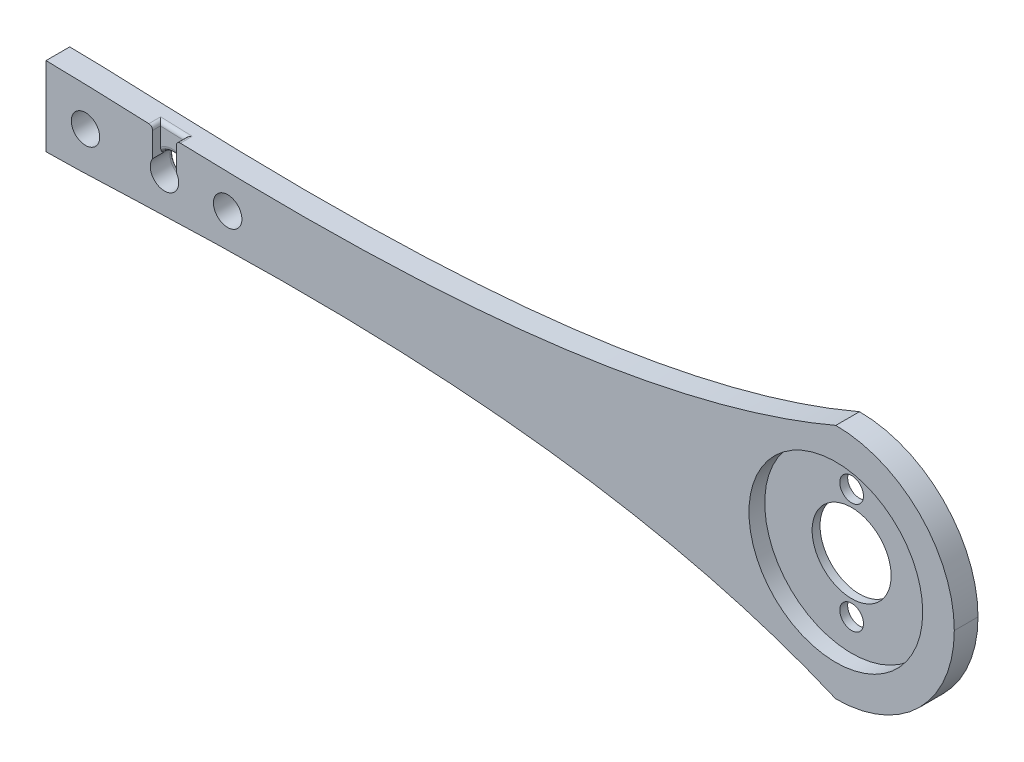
ISO-10303-21;
HEADER;
FILE_DESCRIPTION(('STEP AP214'),'2;1');
FILE_NAME('part.step','',(''),(''),'','','');
FILE_SCHEMA(('AUTOMOTIVE_DESIGN { 1 0 10303 214 1 1 1 1 }'));
ENDSEC;
DATA;
#1=APPLICATION_CONTEXT('core data for automotive mechanical design processes');
#2=APPLICATION_PROTOCOL_DEFINITION('international standard','automotive_design',2000,#1);
#3=PRODUCT_CONTEXT('',#1,'mechanical');
#4=PRODUCT('Part','Part','',(#3));
#5=PRODUCT_RELATED_PRODUCT_CATEGORY('part','',(#4));
#6=PRODUCT_DEFINITION_FORMATION('','',#4);
#7=PRODUCT_DEFINITION_CONTEXT('part definition',#1,'design');
#8=PRODUCT_DEFINITION('design','',#6,#7);
#9=PRODUCT_DEFINITION_SHAPE('','',#8);
#10=(LENGTH_UNIT() NAMED_UNIT(*) SI_UNIT(.MILLI.,.METRE.));
#11=(NAMED_UNIT(*) PLANE_ANGLE_UNIT() SI_UNIT($,.RADIAN.));
#12=(NAMED_UNIT(*) SI_UNIT($,.STERADIAN.) SOLID_ANGLE_UNIT());
#13=UNCERTAINTY_MEASURE_WITH_UNIT(LENGTH_MEASURE(1.E-05),#10,'distance_accuracy_value','');
#14=(GEOMETRIC_REPRESENTATION_CONTEXT(3) GLOBAL_UNCERTAINTY_ASSIGNED_CONTEXT((#13)) GLOBAL_UNIT_ASSIGNED_CONTEXT((#10,
#11,#12)) REPRESENTATION_CONTEXT('',''));
#15=CARTESIAN_POINT('',(0.,0.,0.));
#16=DIRECTION('',(0.,0.,1.));
#17=DIRECTION('',(1.,0.,0.));
#18=AXIS2_PLACEMENT_3D('',#15,#16,#17);
#19=CARTESIAN_POINT('',(-15.,23.7647058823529,3.));
#20=DIRECTION('',(0.,0.,-1.));
#21=DIRECTION('',(-1.,0.,0.));
#22=AXIS2_PLACEMENT_3D('',#19,#20,#21);
#23=CYLINDRICAL_SURFACE('',#22,1.5);
#24=CARTESIAN_POINT('',(-15.,23.7647058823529,0.));
#25=DIRECTION('',(0.,0.,1.));
#26=DIRECTION('',(1.,0.,0.));
#27=AXIS2_PLACEMENT_3D('',#24,#25,#26);
#28=CIRCLE('',#27,1.5);
#29=CARTESIAN_POINT('',(-13.5,23.7647058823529,0.));
#30=VERTEX_POINT('',#29);
#31=EDGE_CURVE('E544',#30,#30,#28,.T.);
#32=ORIENTED_EDGE('',*,*,#31,.F.);
#33=EDGE_LOOP('',(#32));
#34=FACE_BOUND('',#33,.T.);
#35=CARTESIAN_POINT('',(-15.,23.7647058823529,1.));
#36=DIRECTION('',(0.,0.,1.));
#37=DIRECTION('',(1.,0.,0.));
#38=AXIS2_PLACEMENT_3D('',#35,#36,#37);
#39=CIRCLE('',#38,1.5);
#40=CARTESIAN_POINT('',(-13.5,23.7647058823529,1.));
#41=VERTEX_POINT('',#40);
#42=EDGE_CURVE('E638',#41,#41,#39,.F.);
#43=ORIENTED_EDGE('',*,*,#42,.F.);
#44=EDGE_LOOP('',(#43));
#45=FACE_BOUND('',#44,.T.);
#46=ADVANCED_FACE('F186',(#34,#45),#23,.F.);
#47=CARTESIAN_POINT('',(-15.,9.76470588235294,3.));
#48=DIRECTION('',(0.,0.,-1.));
#49=DIRECTION('',(-1.,0.,0.));
#50=AXIS2_PLACEMENT_3D('',#47,#48,#49);
#51=CYLINDRICAL_SURFACE('',#50,1.5);
#52=CARTESIAN_POINT('',(-15.,9.76470588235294,0.));
#53=DIRECTION('',(0.,0.,1.));
#54=DIRECTION('',(1.,0.,0.));
#55=AXIS2_PLACEMENT_3D('',#52,#53,#54);
#56=CIRCLE('',#55,1.5);
#57=CARTESIAN_POINT('',(-13.5,9.76470588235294,0.));
#58=VERTEX_POINT('',#57);
#59=EDGE_CURVE('E541',#58,#58,#56,.T.);
#60=ORIENTED_EDGE('',*,*,#59,.F.);
#61=EDGE_LOOP('',(#60));
#62=FACE_BOUND('',#61,.T.);
#63=CARTESIAN_POINT('',(-15.,9.76470588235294,1.));
#64=DIRECTION('',(0.,0.,1.));
#65=DIRECTION('',(1.,0.,0.));
#66=AXIS2_PLACEMENT_3D('',#63,#64,#65);
#67=CIRCLE('',#66,1.5);
#68=CARTESIAN_POINT('',(-13.5,9.76470588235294,1.));
#69=VERTEX_POINT('',#68);
#70=EDGE_CURVE('E646',#69,#69,#67,.F.);
#71=ORIENTED_EDGE('',*,*,#70,.F.);
#72=EDGE_LOOP('',(#71));
#73=FACE_BOUND('',#72,.T.);
#74=ADVANCED_FACE('F377',(#62,#73),#51,.F.);
#75=CARTESIAN_POINT('',(-15.,16.7647058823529,3.));
#76=DIRECTION('',(0.,0.,-1.));
#77=DIRECTION('',(-1.,0.,0.));
#78=AXIS2_PLACEMENT_3D('',#75,#76,#77);
#79=CYLINDRICAL_SURFACE('',#78,5.);
#80=CARTESIAN_POINT('',(-15.,16.7647058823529,0.));
#81=DIRECTION('',(0.,0.,1.));
#82=DIRECTION('',(1.,0.,0.));
#83=AXIS2_PLACEMENT_3D('',#80,#81,#82);
#84=CIRCLE('',#83,5.);
#85=CARTESIAN_POINT('',(-10.,16.7647058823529,0.));
#86=VERTEX_POINT('',#85);
#87=EDGE_CURVE('E537',#86,#86,#84,.T.);
#88=ORIENTED_EDGE('',*,*,#87,.F.);
#89=EDGE_LOOP('',(#88));
#90=FACE_BOUND('',#89,.T.);
#91=CARTESIAN_POINT('',(-15.,16.7647058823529,1.));
#92=DIRECTION('',(0.,0.,1.));
#93=DIRECTION('',(1.,0.,0.));
#94=AXIS2_PLACEMENT_3D('',#91,#92,#93);
#95=CIRCLE('',#94,5.);
#96=CARTESIAN_POINT('',(-10.,16.7647058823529,1.));
#97=VERTEX_POINT('',#96);
#98=EDGE_CURVE('E552',#97,#97,#95,.F.);
#99=ORIENTED_EDGE('',*,*,#98,.F.);
#100=EDGE_LOOP('',(#99));
#101=FACE_BOUND('',#100,.T.);
#102=ADVANCED_FACE('F381',(#90,#101),#79,.F.);
#103=CARTESIAN_POINT('',(-110.,16.7647058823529,3.));
#104=DIRECTION('',(0.,0.,-1.));
#105=DIRECTION('',(-1.,0.,0.));
#106=AXIS2_PLACEMENT_3D('',#103,#104,#105);
#107=CYLINDRICAL_SURFACE('',#106,1.79999999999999);
#108=CARTESIAN_POINT('',(-110.,16.7647058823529,3.));
#109=DIRECTION('',(0.,0.,1.));
#110=DIRECTION('',(1.,0.,0.));
#111=AXIS2_PLACEMENT_3D('',#108,#109,#110);
#112=CIRCLE('',#111,1.79999999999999);
#113=CARTESIAN_POINT('',(-108.2,16.7647058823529,3.));
#114=VERTEX_POINT('',#113);
#115=EDGE_CURVE('E530',#114,#114,#112,.T.);
#116=ORIENTED_EDGE('',*,*,#115,.T.);
#117=EDGE_LOOP('',(#116));
#118=FACE_BOUND('',#117,.T.);
#119=CARTESIAN_POINT('',(-110.,16.7647058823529,0.));
#120=DIRECTION('',(0.,0.,1.));
#121=DIRECTION('',(1.,0.,0.));
#122=AXIS2_PLACEMENT_3D('',#119,#120,#121);
#123=CIRCLE('',#122,1.79999999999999);
#124=CARTESIAN_POINT('',(-108.2,16.7647058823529,0.));
#125=VERTEX_POINT('',#124);
#126=EDGE_CURVE('E321',#125,#125,#123,.T.);
#127=ORIENTED_EDGE('',*,*,#126,.F.);
#128=EDGE_LOOP('',(#127));
#129=FACE_BOUND('',#128,.T.);
#130=ADVANCED_FACE('F359',(#118,#129),#107,.F.);
#131=CARTESIAN_POINT('',(-115.,11.7647058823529,3.));
#132=CARTESIAN_POINT('',(-100.,11.7647058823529,3.));
#133=CARTESIAN_POINT('',(-50.,16.7647058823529,3.));
#134=CARTESIAN_POINT('',(-15.,1.76470588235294,3.));
#135=B_SPLINE_CURVE_WITH_KNOTS('',3,(#131,#132,#133,#134),.UNSPECIFIED.,.F.,.F.,(4,4),(0.,1.),.UNSPECIFIED.);
#136=DIRECTION('',(0.,0.,-1.));
#137=VECTOR('',#136,1.);
#138=SURFACE_OF_LINEAR_EXTRUSION('',#135,#137);
#139=CARTESIAN_POINT('',(-115.,11.7647058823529,0.));
#140=CARTESIAN_POINT('',(-100.,11.7647058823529,0.));
#141=CARTESIAN_POINT('',(-50.,16.7647058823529,0.));
#142=CARTESIAN_POINT('',(-15.,1.76470588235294,0.));
#143=B_SPLINE_CURVE_WITH_KNOTS('',3,(#139,#140,#141,#142),.UNSPECIFIED.,.F.,.F.,(4,4),(0.,1.),.UNSPECIFIED.);
#144=CARTESIAN_POINT('',(-115.,11.7647058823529,0.));
#145=VERTEX_POINT('',#144);
#146=CARTESIAN_POINT('',(-15.,1.76470588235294,0.));
#147=VERTEX_POINT('',#146);
#148=EDGE_CURVE('E583',#145,#147,#143,.T.);
#149=ORIENTED_EDGE('',*,*,#148,.T.);
#150=DIRECTION('',(0.,0.,-1.));
#151=VECTOR('',#150,1.);
#152=CARTESIAN_POINT('',(-15.,1.76470588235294,3.));
#153=LINE('',#152,#151);
#154=CARTESIAN_POINT('',(-15.,1.76470588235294,3.));
#155=VERTEX_POINT('',#154);
#156=EDGE_CURVE('E579',#155,#147,#153,.T.);
#157=ORIENTED_EDGE('',*,*,#156,.F.);
#158=CARTESIAN_POINT('',(-115.,11.7647058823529,3.));
#159=VERTEX_POINT('',#158);
#160=EDGE_CURVE('E337',#159,#155,#135,.T.);
#161=ORIENTED_EDGE('',*,*,#160,.F.);
#162=DIRECTION('',(0.,0.,-1.));
#163=VECTOR('',#162,1.);
#164=CARTESIAN_POINT('',(-115.,11.7647058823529,3.));
#165=LINE('',#164,#163);
#166=EDGE_CURVE('E554',#159,#145,#165,.T.);
#167=ORIENTED_EDGE('',*,*,#166,.T.);
#168=EDGE_LOOP('',(#149,#157,#161,#167));
#169=FACE_BOUND('',#168,.T.);
#170=ADVANCED_FACE('F354',(#169),#138,.F.);
#171=CARTESIAN_POINT('',(-115.,21.7647058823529,3.));
#172=CARTESIAN_POINT('',(-100.,21.7647058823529,3.));
#173=CARTESIAN_POINT('',(-50.,16.7647058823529,3.));
#174=CARTESIAN_POINT('',(-15.,31.7647058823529,3.));
#175=B_SPLINE_CURVE_WITH_KNOTS('',3,(#171,#172,#173,#174),.UNSPECIFIED.,.F.,.F.,(4,4),(0.,1.),.UNSPECIFIED.);
#176=DIRECTION('',(0.,0.,-1.));
#177=VECTOR('',#176,1.);
#178=SURFACE_OF_LINEAR_EXTRUSION('',#175,#177);
#179=CARTESIAN_POINT('',(-118.909846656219,21.2647058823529,2.));
#180=CARTESIAN_POINT('',(-118.909846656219,21.7647058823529,2.));
#181=CARTESIAN_POINT('',(-118.909846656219,21.7647058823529,1.5));
#182=CARTESIAN_POINT('',(-118.258205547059,21.2647058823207,2.));
#183=CARTESIAN_POINT('',(-118.258205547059,21.7647058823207,2.));
#184=CARTESIAN_POINT('',(-118.258205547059,21.7647058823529,1.5));
#185=CARTESIAN_POINT('',(-117.606564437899,21.2647058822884,2.));
#186=CARTESIAN_POINT('',(-117.606564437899,21.7647058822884,2.));
#187=CARTESIAN_POINT('',(-117.606564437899,21.7647058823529,1.5));
#188=CARTESIAN_POINT('',(-116.303282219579,21.264705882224,2.));
#189=CARTESIAN_POINT('',(-116.303282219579,21.764705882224,2.));
#190=CARTESIAN_POINT('',(-116.303282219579,21.7647058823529,1.5));
#191=CARTESIAN_POINT('',(-115.651641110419,21.2647058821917,2.));
#192=CARTESIAN_POINT('',(-115.651641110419,21.7647058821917,2.));
#193=CARTESIAN_POINT('',(-115.651641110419,21.7647058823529,1.5));
#194=CARTESIAN_POINT('',(-115.000000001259,21.2647058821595,2.));
#195=CARTESIAN_POINT('',(-115.000000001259,21.7647058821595,2.));
#196=CARTESIAN_POINT('',(-115.000000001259,21.7647058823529,1.5));
#197=CARTESIAN_POINT('',(-114.68803054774,21.2646161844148,2.));
#198=CARTESIAN_POINT('',(-114.685733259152,21.764613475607,2.));
#199=CARTESIAN_POINT('',(-114.685733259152,21.7646134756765,1.5));
#200=CARTESIAN_POINT('',(-114.376072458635,21.2625358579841,2.));
#201=CARTESIAN_POINT('',(-114.37187878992,21.7625201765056,2.));
#202=CARTESIAN_POINT('',(-114.37187878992,21.7625201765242,1.5));
#203=CARTESIAN_POINT('',(-113.752201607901,21.2553417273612,2.));
#204=CARTESIAN_POINT('',(-113.744795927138,21.755290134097,2.));
#205=CARTESIAN_POINT('',(-113.744795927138,21.7552901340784,1.5));
#206=CARTESIAN_POINT('',(-113.440288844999,21.2502280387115,2.));
#207=CARTESIAN_POINT('',(-113.431567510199,21.7501535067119,2.));
#208=CARTESIAN_POINT('',(-113.431567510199,21.7501535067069,1.5));
#209=CARTESIAN_POINT('',(-112.816533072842,21.2379153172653,2.));
#210=CARTESIAN_POINT('',(-112.805540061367,21.7377955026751,2.));
#211=CARTESIAN_POINT('',(-112.805540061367,21.7377955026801,1.5));
#212=CARTESIAN_POINT('',(-112.504690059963,21.2307164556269,2.));
#213=CARTESIAN_POINT('',(-112.492740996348,21.7305742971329,2.));
#214=CARTESIAN_POINT('',(-112.492740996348,21.7305742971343,1.5));
#215=CARTESIAN_POINT('',(-111.881040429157,21.2147772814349,2.));
#216=CARTESIAN_POINT('',(-111.867439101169,21.7145929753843,2.));
#217=CARTESIAN_POINT('',(-111.867439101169,21.7145929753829,1.5));
#218=CARTESIAN_POINT('',(-111.56923381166,21.2060369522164,2.));
#219=CARTESIAN_POINT('',(-111.554936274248,21.7058328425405,2.));
#220=CARTESIAN_POINT('',(-111.554936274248,21.70583284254,1.5));
#221=CARTESIAN_POINT('',(-110.633950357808,21.1781600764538,2.));
#222=CARTESIAN_POINT('',(-110.617842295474,21.677902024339,2.));
#223=CARTESIAN_POINT('',(-110.617842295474,21.6779020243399,1.5));
#224=CARTESIAN_POINT('',(-110.010523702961,21.157365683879,2.));
#225=CARTESIAN_POINT('',(-109.993579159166,21.657078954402,2.));
#226=CARTESIAN_POINT('',(-109.993579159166,21.6570789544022,1.5));
#227=CARTESIAN_POINT('',(-108.763738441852,21.1135282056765,2.));
#228=CARTESIAN_POINT('',(-108.745554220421,21.6131977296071,2.));
#229=CARTESIAN_POINT('',(-108.745554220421,21.6131977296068,1.5));
#230=CARTESIAN_POINT('',(-108.140379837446,21.0904850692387,2.));
#231=CARTESIAN_POINT('',(-108.121792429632,21.5901395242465,2.));
#232=CARTESIAN_POINT('',(-108.121792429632,21.5901395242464,1.5));
#233=CARTESIAN_POINT('',(-106.893939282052,21.0434654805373,2.));
#234=CARTESIAN_POINT('',(-106.874830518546,21.5431002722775,2.));
#235=CARTESIAN_POINT('',(-106.874830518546,21.5431002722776,1.5));
#236=CARTESIAN_POINT('',(-106.270857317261,21.0194893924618,2.));
#237=CARTESIAN_POINT('',(-106.251630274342,21.5191195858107,2.));
#238=CARTESIAN_POINT('',(-106.251630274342,21.5191195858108,1.5));
#239=CARTESIAN_POINT('',(-105.024700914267,20.9714822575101,2.));
#240=CARTESIAN_POINT('',(-105.00543602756,21.4711109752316,2.));
#241=CARTESIAN_POINT('',(-105.00543602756,21.4711109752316,1.5));
#242=CARTESIAN_POINT('',(-104.401626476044,20.9474512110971,2.));
#243=CARTESIAN_POINT('',(-104.382442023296,21.4470830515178,2.));
#244=CARTESIAN_POINT('',(-104.382442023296,21.4470830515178,1.5));
#245=CARTESIAN_POINT('',(-102.532289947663,20.8762599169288,2.));
#246=CARTESIAN_POINT('',(-102.51356300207,21.3759091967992,2.));
#247=CARTESIAN_POINT('',(-102.51356300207,21.3759091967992,1.5));
#248=CARTESIAN_POINT('',(-101.285992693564,20.83000463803,2.));
#249=CARTESIAN_POINT('',(-101.267859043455,21.3296763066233,2.));
#250=CARTESIAN_POINT('',(-101.267859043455,21.3296763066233,1.5));
#251=CARTESIAN_POINT('',(-98.4658210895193,20.7319844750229,2.));
#252=CARTESIAN_POINT('',(-98.4494243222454,21.231716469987,2.));
#253=CARTESIAN_POINT('',(-98.4494243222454,21.231716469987,1.5));
#254=CARTESIAN_POINT('',(-96.8918840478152,20.6819633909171,2.));
#255=CARTESIAN_POINT('',(-96.8767344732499,21.1817358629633,2.));
#256=CARTESIAN_POINT('',(-96.8767344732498,21.1817358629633,1.5));
#257=CARTESIAN_POINT('',(-93.743631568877,20.595532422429,2.));
#258=CARTESIAN_POINT('',(-93.7313420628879,21.0953834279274,2.));
#259=CARTESIAN_POINT('',(-93.7313420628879,21.0953834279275,1.5));
#260=CARTESIAN_POINT('',(-92.1693161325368,20.5591225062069,2.));
#261=CARTESIAN_POINT('',(-92.1586395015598,21.0590115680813,2.));
#262=CARTESIAN_POINT('',(-92.1586395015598,21.0590115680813,1.5));
#263=CARTESIAN_POINT('',(-89.0205192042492,20.5029154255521,2.));
#264=CARTESIAN_POINT('',(-89.0133493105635,21.0028671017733,2.));
#265=CARTESIAN_POINT('',(-89.0133493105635,21.0028671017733,1.5));
#266=CARTESIAN_POINT('',(-87.4460377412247,20.4831167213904,2.));
#267=CARTESIAN_POINT('',(-87.4407616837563,20.9830929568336,2.));
#268=CARTESIAN_POINT('',(-87.4407616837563,20.9830929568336,1.5));
#269=CARTESIAN_POINT('',(-84.2969522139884,20.462575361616,2.));
#270=CARTESIAN_POINT('',(-84.2957062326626,20.9625778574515,2.));
#271=CARTESIAN_POINT('',(-84.2957062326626,20.9625778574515,1.5));
#272=CARTESIAN_POINT('',(-82.7223481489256,20.4618328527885,2.));
#273=CARTESIAN_POINT('',(-82.7232384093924,20.9618370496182,2.));
#274=CARTESIAN_POINT('',(-82.7232384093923,20.9618370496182,1.5));
#275=CARTESIAN_POINT('',(-77.9966422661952,20.4914961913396,2.));
#276=CARTESIAN_POINT('',(-78.0042811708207,20.9914582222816,2.));
#277=CARTESIAN_POINT('',(-78.0042811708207,20.9914582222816,1.5));
#278=CARTESIAN_POINT('',(-74.845597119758,20.5538333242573,2.));
#279=CARTESIAN_POINT('',(-74.8581861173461,21.0537041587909,2.));
#280=CARTESIAN_POINT('',(-74.8581861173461,21.0537041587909,1.5));
#281=CARTESIAN_POINT('',(-70.1212094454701,20.7240100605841,2.));
#282=CARTESIAN_POINT('',(-70.1419151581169,21.2235884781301,2.));
#283=CARTESIAN_POINT('',(-70.1419151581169,21.2235884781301,1.5));
#284=CARTESIAN_POINT('',(-68.5464374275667,20.7935374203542,2.));
#285=CARTESIAN_POINT('',(-68.5699646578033,21.2929923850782,2.));
#286=CARTESIAN_POINT('',(-68.5699646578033,21.2929923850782,1.5));
#287=CARTESIAN_POINT('',(-65.3982800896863,20.9604659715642,2.));
#288=CARTESIAN_POINT('',(-65.4276980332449,21.459608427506,2.));
#289=CARTESIAN_POINT('',(-65.4276980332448,21.459608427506,1.5));
#290=CARTESIAN_POINT('',(-63.8248948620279,21.0578688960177,2.));
#291=CARTESIAN_POINT('',(-63.8573820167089,21.5568222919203,2.));
#292=CARTESIAN_POINT('',(-63.8573820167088,21.5568222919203,1.5));
#293=CARTESIAN_POINT('',(-62.2525173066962,21.1703569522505,2.));
#294=CARTESIAN_POINT('',(-62.2882060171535,21.6690816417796,2.));
#295=CARTESIAN_POINT('',(-62.2882060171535,21.6690816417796,1.5));
#296=(BOUNDED_SURFACE() B_SPLINE_SURFACE(3,2,((#179,#180,#181),(#182,#183,#184),(#185,#186,
#187),(#188,#189,#190),(#191,#192,#193),(#194,#195,#196),(#197,#198,#199),(#200,#201,#202),
(#203,#204,#205),(#206,#207,#208),(#209,#210,#211),(#212,#213,#214),(#215,#216,#217),(#218,#219,
#220),(#221,#222,#223),(#224,#225,#226),(#227,#228,#229),(#230,#231,#232),(#233,#234,#235),
(#236,#237,#238),(#239,#240,#241),(#242,#243,#244),(#245,#246,#247),(#248,#249,#250),(#251,#252,
#253),(#254,#255,#256),(#257,#258,#259),(#260,#261,#262),(#263,#264,#265),(#266,#267,#268),
(#269,#270,#271),(#272,#273,#274),(#275,#276,#277),(#278,#279,#280),(#281,#282,#283),(#284,#285,
#286),(#287,#288,#289),(#290,#291,#292),(#293,#294,#295)),.UNSPECIFIED.,.F.,.F.,
.F.) B_SPLINE_SURFACE_WITH_KNOTS((4,2,3,2,2,2,2,2,2,2,2,2,2,2,2,2,2,2,4),(3,3),(0.,
1.95492332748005,3.90984665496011,4.84573333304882,5.78158436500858,6.71735860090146,
7.65314295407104,9.52445294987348,11.3958052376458,13.2664342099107,15.1370474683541,
18.8785083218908,23.6026591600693,28.3267989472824,33.0505007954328,37.7742390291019,
47.227566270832,51.9562704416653,56.6852686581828),(0.,1.),
.UNSPECIFIED.) GEOMETRIC_REPRESENTATION_ITEM() RATIONAL_B_SPLINE_SURFACE(((1.,0.707106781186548,
1.),(1.,0.707106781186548,1.),(1.,0.707106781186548,1.),(1.,0.707106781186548,1.),(1.,
0.707106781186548,1.),(1.,0.707106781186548,1.),(1.,0.707106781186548,1.),(1.,0.707106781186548,
1.),(1.,0.707106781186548,1.),(1.,0.707106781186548,1.),(1.,0.707106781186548,1.),(1.,
0.707106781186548,1.),(1.,0.707106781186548,1.),(1.,0.707106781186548,1.),(1.,0.707106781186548,
1.),(1.,0.707106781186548,1.),(1.,0.707106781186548,1.),(1.,0.707106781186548,1.),(1.,
0.707106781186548,1.),(1.,0.707106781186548,1.),(1.,0.707106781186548,1.),(1.,0.707106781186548,
1.),(1.,0.707106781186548,1.),(1.,0.707106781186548,1.),(1.,0.707106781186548,1.),(1.,
0.707106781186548,1.),(1.,0.707106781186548,1.),(1.,0.707106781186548,1.),(1.,0.707106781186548,
1.),(1.,0.707106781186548,1.),(1.,0.707106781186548,1.),(1.,0.707106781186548,1.),(1.,
0.707106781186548,1.),(1.,0.707106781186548,1.),(1.,0.707106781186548,1.),(1.,0.707106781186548,
1.),(1.,0.707106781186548,1.),(1.,0.707106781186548,1.),(1.,0.707106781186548,1.))) REPRESENTATION_ITEM('') SURFACE());
#297=CARTESIAN_POINT('',(-118.909846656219,21.7647058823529,1.5));
#298=CARTESIAN_POINT('',(-118.258205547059,21.7647058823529,1.5));
#299=CARTESIAN_POINT('',(-117.606564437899,21.7647058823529,1.5));
#300=CARTESIAN_POINT('',(-116.303282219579,21.7647058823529,1.5));
#301=CARTESIAN_POINT('',(-115.651641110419,21.7647058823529,1.5));
#302=CARTESIAN_POINT('',(-115.000000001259,21.7647058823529,1.5));
#303=CARTESIAN_POINT('',(-114.685733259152,21.7646134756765,1.5));
#304=CARTESIAN_POINT('',(-114.37187878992,21.7625201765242,1.5));
#305=CARTESIAN_POINT('',(-113.744795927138,21.7552901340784,1.5));
#306=CARTESIAN_POINT('',(-113.431567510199,21.7501535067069,1.5));
#307=CARTESIAN_POINT('',(-112.805540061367,21.7377955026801,1.5));
#308=CARTESIAN_POINT('',(-112.492740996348,21.7305742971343,1.5));
#309=CARTESIAN_POINT('',(-111.867439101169,21.7145929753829,1.5));
#310=CARTESIAN_POINT('',(-111.554936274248,21.70583284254,1.5));
#311=CARTESIAN_POINT('',(-110.617842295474,21.6779020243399,1.5));
#312=CARTESIAN_POINT('',(-109.993579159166,21.6570789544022,1.5));
#313=CARTESIAN_POINT('',(-108.745554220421,21.6131977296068,1.5));
#314=CARTESIAN_POINT('',(-108.121792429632,21.5901395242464,1.5));
#315=CARTESIAN_POINT('',(-106.874830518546,21.5431002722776,1.5));
#316=CARTESIAN_POINT('',(-106.251630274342,21.5191195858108,1.5));
#317=CARTESIAN_POINT('',(-105.00543602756,21.4711109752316,1.5));
#318=CARTESIAN_POINT('',(-104.382442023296,21.4470830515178,1.5));
#319=CARTESIAN_POINT('',(-102.51356300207,21.3759091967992,1.5));
#320=CARTESIAN_POINT('',(-101.267859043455,21.3296763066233,1.5));
#321=CARTESIAN_POINT('',(-98.4494243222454,21.231716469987,1.5));
#322=CARTESIAN_POINT('',(-96.8767344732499,21.1817358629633,1.5));
#323=CARTESIAN_POINT('',(-93.7313420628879,21.0953834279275,1.5));
#324=CARTESIAN_POINT('',(-92.1586395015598,21.0590115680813,1.5));
#325=CARTESIAN_POINT('',(-89.0133493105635,21.0028671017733,1.5));
#326=CARTESIAN_POINT('',(-87.4407616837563,20.9830929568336,1.5));
#327=CARTESIAN_POINT('',(-84.2957062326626,20.9625778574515,1.5));
#328=CARTESIAN_POINT('',(-82.7232384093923,20.9618370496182,1.5));
#329=CARTESIAN_POINT('',(-78.0042811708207,20.9914582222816,1.5));
#330=CARTESIAN_POINT('',(-74.8581861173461,21.0537041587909,1.5));
#331=CARTESIAN_POINT('',(-70.1419151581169,21.2235884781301,1.5));
#332=CARTESIAN_POINT('',(-68.5699646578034,21.2929923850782,1.5));
#333=CARTESIAN_POINT('',(-65.4276980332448,21.459608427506,1.5));
#334=CARTESIAN_POINT('',(-63.8573820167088,21.5568222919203,1.5));
#335=CARTESIAN_POINT('',(-62.2882060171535,21.6690816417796,1.5));
#336=B_SPLINE_CURVE_WITH_KNOTS('',3,(#297,#298,#299,#300,#301,#302,#303,#304,#305,#306,#307,
#308,#309,#310,#311,#312,#313,#314,#315,#316,#317,#318,#319,#320,#321,#322,#323,#324,#325,#326,
#327,#328,#329,#330,#331,#332,#333,#334,#335),.UNSPECIFIED.,.F.,.F.,(4,2,3,2,2,2,2,2,2,2,2,2,2,
2,2,2,2,2,4),(0.,1.95492332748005,3.90984665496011,4.84573333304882,5.78158436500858,
6.71735860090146,7.65314295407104,9.52445294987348,11.3958052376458,13.2664342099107,
15.1370474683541,18.8785083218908,23.6026591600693,28.3267989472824,33.0505007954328,
37.7742390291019,47.227566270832,51.9562704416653,56.6852686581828),.UNSPECIFIED.);
#337=CARTESIAN_POINT('',(-101.981588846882,21.3566371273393,1.5));
#338=VERTEX_POINT('',#337);
#339=CARTESIAN_POINT('',(-97.9840390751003,21.2183190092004,1.5));
#340=VERTEX_POINT('',#339);
#341=EDGE_CURVE('E463',#338,#340,#336,.T.);
#342=ORIENTED_EDGE('',*,*,#341,.T.);
#343=DIRECTION('',(0.,0.,-1.));
#344=VECTOR('',#343,1.);
#345=CARTESIAN_POINT('',(-97.9840390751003,21.2183190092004,1.5));
#346=LINE('',#345,#344);
#347=CARTESIAN_POINT('',(-97.9840390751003,21.2183190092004,3.));
#348=VERTEX_POINT('',#347);
#349=EDGE_CURVE('E473',#340,#348,#346,.F.);
#350=ORIENTED_EDGE('',*,*,#349,.T.);
#351=CARTESIAN_POINT('',(-15.,31.7647058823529,3.));
#352=VERTEX_POINT('',#351);
#353=EDGE_CURVE('E344',#348,#352,#175,.T.);
#354=ORIENTED_EDGE('',*,*,#353,.T.);
#355=DIRECTION('',(0.,0.,-1.));
#356=VECTOR('',#355,1.);
#357=CARTESIAN_POINT('',(-15.,31.7647058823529,3.));
#358=LINE('',#357,#356);
#359=CARTESIAN_POINT('',(-15.,31.7647058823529,0.));
#360=VERTEX_POINT('',#359);
#361=EDGE_CURVE('E578',#352,#360,#358,.T.);
#362=ORIENTED_EDGE('',*,*,#361,.T.);
#363=CARTESIAN_POINT('',(-115.,21.7647058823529,0.));
#364=CARTESIAN_POINT('',(-100.,21.7647058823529,0.));
#365=CARTESIAN_POINT('',(-50.,16.7647058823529,0.));
#366=CARTESIAN_POINT('',(-15.,31.7647058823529,0.));
#367=B_SPLINE_CURVE_WITH_KNOTS('',3,(#363,#364,#365,#366),.UNSPECIFIED.,.F.,.F.,(4,4),(0.,1.),.UNSPECIFIED.);
#368=CARTESIAN_POINT('',(-115.,21.7647058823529,0.));
#369=VERTEX_POINT('',#368);
#370=EDGE_CURVE('E329',#369,#360,#367,.T.);
#371=ORIENTED_EDGE('',*,*,#370,.F.);
#372=DIRECTION('',(0.,0.,-1.));
#373=VECTOR('',#372,1.);
#374=CARTESIAN_POINT('',(-115.,21.7647058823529,3.));
#375=LINE('',#374,#373);
#376=CARTESIAN_POINT('',(-115.,21.7647058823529,3.));
#377=VERTEX_POINT('',#376);
#378=EDGE_CURVE('E607',#377,#369,#375,.T.);
#379=ORIENTED_EDGE('',*,*,#378,.F.);
#380=CARTESIAN_POINT('',(-101.981588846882,21.3566371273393,3.));
#381=VERTEX_POINT('',#380);
#382=EDGE_CURVE('E345',#377,#381,#175,.T.);
#383=ORIENTED_EDGE('',*,*,#382,.T.);
#384=DIRECTION('',(0.,0.,-1.));
#385=VECTOR('',#384,1.);
#386=CARTESIAN_POINT('',(-101.981588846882,21.3566371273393,3.));
#387=LINE('',#386,#385);
#388=EDGE_CURVE('E470',#381,#338,#387,.T.);
#389=ORIENTED_EDGE('',*,*,#388,.T.);
#390=EDGE_LOOP('',(#342,#350,#354,#362,#371,#379,#383,#389));
#391=FACE_BOUND('',#390,.T.);
#392=ADVANCED_FACE('F358',(#391),#178,.T.);
#393=CARTESIAN_POINT('',(-115.,0.,3.));
#394=DIRECTION('',(1.,0.,0.));
#395=DIRECTION('',(0.,0.,-1.));
#396=AXIS2_PLACEMENT_3D('',#393,#394,#395);
#397=PLANE('',#396);
#398=DIRECTION('',(0.,-1.,0.));
#399=VECTOR('',#398,1.);
#400=CARTESIAN_POINT('',(-115.,0.,0.));
#401=LINE('',#400,#399);
#402=EDGE_CURVE('E589',#369,#145,#401,.T.);
#403=ORIENTED_EDGE('',*,*,#402,.T.);
#404=ORIENTED_EDGE('',*,*,#166,.F.);
#405=DIRECTION('',(0.,-1.,0.));
#406=VECTOR('',#405,1.);
#407=CARTESIAN_POINT('',(-115.,0.,3.));
#408=LINE('',#407,#406);
#409=EDGE_CURVE('E326',#377,#159,#408,.T.);
#410=ORIENTED_EDGE('',*,*,#409,.F.);
#411=ORIENTED_EDGE('',*,*,#378,.T.);
#412=EDGE_LOOP('',(#403,#404,#410,#411));
#413=FACE_BOUND('',#412,.T.);
#414=ADVANCED_FACE('F363',(#413),#397,.F.);
#415=CARTESIAN_POINT('',(-92.,16.7647058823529,3.));
#416=DIRECTION('',(0.,0.,-1.));
#417=DIRECTION('',(-1.,0.,0.));
#418=AXIS2_PLACEMENT_3D('',#415,#416,#417);
#419=CYLINDRICAL_SURFACE('',#418,1.79999999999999);
#420=CARTESIAN_POINT('',(-92.,16.7647058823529,3.));
#421=DIRECTION('',(0.,0.,1.));
#422=DIRECTION('',(1.,0.,0.));
#423=AXIS2_PLACEMENT_3D('',#420,#421,#422);
#424=CIRCLE('',#423,1.79999999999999);
#425=CARTESIAN_POINT('',(-90.2,16.7647058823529,3.));
#426=VERTEX_POINT('',#425);
#427=EDGE_CURVE('E320',#426,#426,#424,.T.);
#428=ORIENTED_EDGE('',*,*,#427,.T.);
#429=EDGE_LOOP('',(#428));
#430=FACE_BOUND('',#429,.T.);
#431=CARTESIAN_POINT('',(-92.,16.7647058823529,0.));
#432=DIRECTION('',(0.,0.,1.));
#433=DIRECTION('',(1.,0.,0.));
#434=AXIS2_PLACEMENT_3D('',#431,#432,#433);
#435=CIRCLE('',#434,1.79999999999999);
#436=CARTESIAN_POINT('',(-90.2,16.7647058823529,0.));
#437=VERTEX_POINT('',#436);
#438=EDGE_CURVE('E559',#437,#437,#435,.T.);
#439=ORIENTED_EDGE('',*,*,#438,.F.);
#440=EDGE_LOOP('',(#439));
#441=FACE_BOUND('',#440,.T.);
#442=ADVANCED_FACE('F366',(#430,#441),#419,.F.);
#443=CARTESIAN_POINT('',(-100.,16.7647058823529,3.));
#444=DIRECTION('',(0.,0.,-1.));
#445=DIRECTION('',(-1.,0.,0.));
#446=AXIS2_PLACEMENT_3D('',#443,#444,#445);
#447=CYLINDRICAL_SURFACE('',#446,1.79999999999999);
#448=CARTESIAN_POINT('',(-100.,16.7647058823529,0.5));
#449=DIRECTION('',(0.,0.,1.));
#450=DIRECTION('',(1.,0.,0.));
#451=AXIS2_PLACEMENT_3D('',#448,#449,#450);
#452=CIRCLE('',#451,1.79999999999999);
#453=CARTESIAN_POINT('',(-98.2,16.7647058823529,0.5));
#454=VERTEX_POINT('',#453);
#455=EDGE_CURVE('E444',#454,#454,#452,.F.);
#456=ORIENTED_EDGE('',*,*,#455,.T.);
#457=EDGE_LOOP('',(#456));
#458=FACE_BOUND('',#457,.T.);
#459=CARTESIAN_POINT('',(-100.,16.7647058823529,1.5));
#460=DIRECTION('',(0.,0.,1.));
#461=DIRECTION('',(1.,0.,0.));
#462=AXIS2_PLACEMENT_3D('',#459,#460,#461);
#463=CIRCLE('',#462,1.79999999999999);
#464=CARTESIAN_POINT('',(-98.5,17.7596933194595,1.5));
#465=VERTEX_POINT('',#464);
#466=CARTESIAN_POINT('',(-101.5,17.7596933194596,1.5));
#467=VERTEX_POINT('',#466);
#468=EDGE_CURVE('E308',#465,#467,#463,.T.);
#469=ORIENTED_EDGE('',*,*,#468,.T.);
#470=DIRECTION('',(0.,0.,-1.));
#471=VECTOR('',#470,1.);
#472=CARTESIAN_POINT('',(-101.5,17.7596933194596,3.));
#473=LINE('',#472,#471);
#474=CARTESIAN_POINT('',(-101.5,17.7596933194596,3.));
#475=VERTEX_POINT('',#474);
#476=EDGE_CURVE('E295',#475,#467,#473,.T.);
#477=ORIENTED_EDGE('',*,*,#476,.F.);
#478=CARTESIAN_POINT('',(-100.,16.7647058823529,3.));
#479=DIRECTION('',(0.,0.,1.));
#480=DIRECTION('',(1.,0.,0.));
#481=AXIS2_PLACEMENT_3D('',#478,#479,#480);
#482=CIRCLE('',#481,1.79999999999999);
#483=CARTESIAN_POINT('',(-98.5,17.7596933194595,3.));
#484=VERTEX_POINT('',#483);
#485=EDGE_CURVE('E306',#475,#484,#482,.T.);
#486=ORIENTED_EDGE('',*,*,#485,.T.);
#487=DIRECTION('',(0.,0.,-1.));
#488=VECTOR('',#487,1.);
#489=CARTESIAN_POINT('',(-98.5,17.7596933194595,3.));
#490=LINE('',#489,#488);
#491=EDGE_CURVE('E311',#465,#484,#490,.F.);
#492=ORIENTED_EDGE('',*,*,#491,.F.);
#493=EDGE_LOOP('',(#469,#477,#486,#492));
#494=FACE_BOUND('',#493,.T.);
#495=ADVANCED_FACE('F305',(#458,#494),#447,.F.);
#496=CARTESIAN_POINT('',(0.,0.,0.));
#497=DIRECTION('',(0.,0.,1.));
#498=DIRECTION('',(1.,0.,0.));
#499=AXIS2_PLACEMENT_3D('',#496,#497,#498);
#500=PLANE('',#499);
#501=CARTESIAN_POINT('',(-100.,16.7647058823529,0.));
#502=DIRECTION('',(0.,0.,1.));
#503=DIRECTION('',(1.,0.,0.));
#504=AXIS2_PLACEMENT_3D('',#501,#502,#503);
#505=CIRCLE('',#504,2.29999999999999);
#506=CARTESIAN_POINT('',(-97.7,16.7647058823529,0.));
#507=VERTEX_POINT('',#506);
#508=EDGE_CURVE('E447',#507,#507,#505,.T.);
#509=ORIENTED_EDGE('',*,*,#508,.T.);
#510=EDGE_LOOP('',(#509));
#511=FACE_BOUND('',#510,.T.);
#512=ORIENTED_EDGE('',*,*,#438,.T.);
#513=EDGE_LOOP('',(#512));
#514=FACE_BOUND('',#513,.T.);
#515=CARTESIAN_POINT('',(-15.,16.7647058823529,0.));
#516=DIRECTION('',(0.,0.,1.));
#517=DIRECTION('',(1.,0.,0.));
#518=AXIS2_PLACEMENT_3D('',#515,#516,#517);
#519=CIRCLE('',#518,15.);
#520=CARTESIAN_POINT('',(0.,16.7647058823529,0.));
#521=VERTEX_POINT('',#520);
#522=EDGE_CURVE('E560',#360,#521,#519,.F.);
#523=ORIENTED_EDGE('',*,*,#522,.T.);
#524=CARTESIAN_POINT('',(-15.,16.7647058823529,0.));
#525=DIRECTION('',(0.,0.,1.));
#526=DIRECTION('',(1.,0.,0.));
#527=AXIS2_PLACEMENT_3D('',#524,#525,#526);
#528=CIRCLE('',#527,15.);
#529=EDGE_CURVE('E563',#521,#147,#528,.F.);
#530=ORIENTED_EDGE('',*,*,#529,.T.);
#531=ORIENTED_EDGE('',*,*,#148,.F.);
#532=ORIENTED_EDGE('',*,*,#402,.F.);
#533=ORIENTED_EDGE('',*,*,#370,.T.);
#534=EDGE_LOOP('',(#523,#530,#531,#532,#533));
#535=FACE_BOUND('',#534,.T.);
#536=ORIENTED_EDGE('',*,*,#126,.T.);
#537=EDGE_LOOP('',(#536));
#538=FACE_BOUND('',#537,.T.);
#539=ORIENTED_EDGE('',*,*,#87,.T.);
#540=EDGE_LOOP('',(#539));
#541=FACE_BOUND('',#540,.T.);
#542=ORIENTED_EDGE('',*,*,#59,.T.);
#543=EDGE_LOOP('',(#542));
#544=FACE_BOUND('',#543,.T.);
#545=ORIENTED_EDGE('',*,*,#31,.T.);
#546=EDGE_LOOP('',(#545));
#547=FACE_BOUND('',#546,.T.);
#548=ADVANCED_FACE('F373',(#511,#514,#535,#538,#541,#544,#547),#500,.F.);
#549=CARTESIAN_POINT('',(0.,0.,3.));
#550=DIRECTION('',(0.,0.,1.));
#551=DIRECTION('',(1.,0.,0.));
#552=AXIS2_PLACEMENT_3D('',#549,#550,#551);
#553=PLANE('',#552);
#554=ORIENTED_EDGE('',*,*,#353,.F.);
#555=CARTESIAN_POINT('',(-97.9999999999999,20.7185738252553,3.));
#556=DIRECTION('',(0.,0.,1.));
#557=DIRECTION('',(1.,0.,0.));
#558=AXIS2_PLACEMENT_3D('',#555,#556,#557);
#559=CIRCLE('',#558,0.5);
#560=CARTESIAN_POINT('',(-98.5,20.7185738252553,3.));
#561=VERTEX_POINT('',#560);
#562=EDGE_CURVE('E479',#348,#561,#559,.T.);
#563=ORIENTED_EDGE('',*,*,#562,.T.);
#564=DIRECTION('',(0.,1.,0.));
#565=VECTOR('',#564,1.);
#566=CARTESIAN_POINT('',(-98.5,0.,3.));
#567=LINE('',#566,#565);
#568=EDGE_CURVE('E318',#484,#561,#567,.T.);
#569=ORIENTED_EDGE('',*,*,#568,.F.);
#570=ORIENTED_EDGE('',*,*,#485,.F.);
#571=DIRECTION('',(0.,-1.,0.));
#572=VECTOR('',#571,1.);
#573=CARTESIAN_POINT('',(-101.5,21.3389987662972,3.));
#574=LINE('',#573,#572);
#575=CARTESIAN_POINT('',(-101.5,20.8569762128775,3.));
#576=VERTEX_POINT('',#575);
#577=EDGE_CURVE('E291',#576,#475,#574,.T.);
#578=ORIENTED_EDGE('',*,*,#577,.F.);
#579=CARTESIAN_POINT('',(-102.,20.8569762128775,3.));
#580=DIRECTION('',(0.,0.,1.));
#581=DIRECTION('',(1.,0.,0.));
#582=AXIS2_PLACEMENT_3D('',#579,#580,#581);
#583=CIRCLE('',#582,0.5);
#584=EDGE_CURVE('E476',#576,#381,#583,.T.);
#585=ORIENTED_EDGE('',*,*,#584,.T.);
#586=ORIENTED_EDGE('',*,*,#382,.F.);
#587=ORIENTED_EDGE('',*,*,#409,.T.);
#588=ORIENTED_EDGE('',*,*,#160,.T.);
#589=CARTESIAN_POINT('',(-15.,16.7647058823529,3.));
#590=DIRECTION('',(0.,0.,1.));
#591=DIRECTION('',(1.,0.,0.));
#592=AXIS2_PLACEMENT_3D('',#589,#590,#591);
#593=CIRCLE('',#592,15.);
#594=CARTESIAN_POINT('',(0.,16.7647058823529,3.));
#595=VERTEX_POINT('',#594);
#596=EDGE_CURVE('E454',#155,#595,#593,.T.);
#597=ORIENTED_EDGE('',*,*,#596,.T.);
#598=CARTESIAN_POINT('',(-15.,16.7647058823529,3.));
#599=DIRECTION('',(0.,0.,1.));
#600=DIRECTION('',(1.,0.,0.));
#601=AXIS2_PLACEMENT_3D('',#598,#599,#600);
#602=CIRCLE('',#601,15.);
#603=EDGE_CURVE('E566',#595,#352,#602,.T.);
#604=ORIENTED_EDGE('',*,*,#603,.T.);
#605=EDGE_LOOP('',(#554,#563,#569,#570,#578,#585,#586,#587,#588,#597,#604));
#606=FACE_BOUND('',#605,.T.);
#607=CARTESIAN_POINT('',(-15.,16.7647058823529,3.));
#608=DIRECTION('',(0.,0.,1.));
#609=DIRECTION('',(1.,0.,0.));
#610=AXIS2_PLACEMENT_3D('',#607,#608,#609);
#611=CIRCLE('',#610,11.);
#612=CARTESIAN_POINT('',(-4.,16.7647058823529,3.));
#613=VERTEX_POINT('',#612);
#614=EDGE_CURVE('E310',#613,#613,#611,.T.);
#615=ORIENTED_EDGE('',*,*,#614,.F.);
#616=EDGE_LOOP('',(#615));
#617=FACE_BOUND('',#616,.T.);
#618=ORIENTED_EDGE('',*,*,#427,.F.);
#619=EDGE_LOOP('',(#618));
#620=FACE_BOUND('',#619,.T.);
#621=ORIENTED_EDGE('',*,*,#115,.F.);
#622=EDGE_LOOP('',(#621));
#623=FACE_BOUND('',#622,.T.);
#624=ADVANCED_FACE('F315',(#606,#617,#620,#623),#553,.T.);
#625=CARTESIAN_POINT('',(-15.,16.7647058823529,1.5));
#626=DIRECTION('',(0.,0.,-1.));
#627=DIRECTION('',(-1.,0.,0.));
#628=AXIS2_PLACEMENT_3D('',#625,#626,#627);
#629=CYLINDRICAL_SURFACE('',#628,15.);
#630=ORIENTED_EDGE('',*,*,#361,.F.);
#631=ORIENTED_EDGE('',*,*,#603,.F.);
#632=DIRECTION('',(0.,0.,-1.));
#633=VECTOR('',#632,1.);
#634=CARTESIAN_POINT('',(0.,16.7647058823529,3.));
#635=LINE('',#634,#633);
#636=EDGE_CURVE('E546',#521,#595,#635,.F.);
#637=ORIENTED_EDGE('',*,*,#636,.F.);
#638=ORIENTED_EDGE('',*,*,#522,.F.);
#639=EDGE_LOOP('',(#630,#631,#637,#638));
#640=FACE_BOUND('',#639,.T.);
#641=ADVANCED_FACE('F390',(#640),#629,.T.);
#642=CARTESIAN_POINT('',(-15.,16.7647058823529,1.5));
#643=DIRECTION('',(0.,0.,-1.));
#644=DIRECTION('',(-1.,0.,0.));
#645=AXIS2_PLACEMENT_3D('',#642,#643,#644);
#646=CYLINDRICAL_SURFACE('',#645,15.);
#647=ORIENTED_EDGE('',*,*,#596,.F.);
#648=ORIENTED_EDGE('',*,*,#156,.T.);
#649=ORIENTED_EDGE('',*,*,#529,.F.);
#650=ORIENTED_EDGE('',*,*,#636,.T.);
#651=EDGE_LOOP('',(#647,#648,#649,#650));
#652=FACE_BOUND('',#651,.T.);
#653=ADVANCED_FACE('F386',(#652),#646,.T.);
#654=CARTESIAN_POINT('',(-15.,16.7647058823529,1.));
#655=DIRECTION('',(0.,0.,1.));
#656=DIRECTION('',(1.,0.,0.));
#657=AXIS2_PLACEMENT_3D('',#654,#655,#656);
#658=CYLINDRICAL_SURFACE('',#657,11.);
#659=CARTESIAN_POINT('',(-15.,16.7647058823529,1.));
#660=DIRECTION('',(0.,0.,1.));
#661=DIRECTION('',(1.,0.,0.));
#662=AXIS2_PLACEMENT_3D('',#659,#660,#661);
#663=CIRCLE('',#662,11.);
#664=CARTESIAN_POINT('',(-4.,16.7647058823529,1.));
#665=VERTEX_POINT('',#664);
#666=EDGE_CURVE('E642',#665,#665,#663,.T.);
#667=ORIENTED_EDGE('',*,*,#666,.F.);
#668=EDGE_LOOP('',(#667));
#669=FACE_BOUND('',#668,.T.);
#670=ORIENTED_EDGE('',*,*,#614,.T.);
#671=EDGE_LOOP('',(#670));
#672=FACE_BOUND('',#671,.T.);
#673=ADVANCED_FACE('F389',(#669,#672),#658,.F.);
#674=CARTESIAN_POINT('',(0.,0.,1.));
#675=DIRECTION('',(0.,0.,1.));
#676=DIRECTION('',(1.,0.,0.));
#677=AXIS2_PLACEMENT_3D('',#674,#675,#676);
#678=PLANE('',#677);
#679=ORIENTED_EDGE('',*,*,#42,.T.);
#680=EDGE_LOOP('',(#679));
#681=FACE_BOUND('',#680,.T.);
#682=ORIENTED_EDGE('',*,*,#666,.T.);
#683=EDGE_LOOP('',(#682));
#684=FACE_BOUND('',#683,.T.);
#685=ORIENTED_EDGE('',*,*,#70,.T.);
#686=EDGE_LOOP('',(#685));
#687=FACE_BOUND('',#686,.T.);
#688=ORIENTED_EDGE('',*,*,#98,.T.);
#689=EDGE_LOOP('',(#688));
#690=FACE_BOUND('',#689,.T.);
#691=ADVANCED_FACE('F511',(#681,#684,#687,#690),#678,.T.);
#692=CARTESIAN_POINT('',(-101.5,21.3389987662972,2.));
#693=DIRECTION('',(-1.,0.,0.));
#694=DIRECTION('',(0.,-1.,0.));
#695=AXIS2_PLACEMENT_3D('',#692,#693,#694);
#696=PLANE('',#695);
#697=DIRECTION('',(0.,-1.,0.));
#698=VECTOR('',#697,1.);
#699=CARTESIAN_POINT('',(-101.5,21.3389987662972,2.));
#700=LINE('',#699,#698);
#701=CARTESIAN_POINT('',(-101.5,20.8386678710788,2.));
#702=VERTEX_POINT('',#701);
#703=CARTESIAN_POINT('',(-101.5,18.5082654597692,2.));
#704=VERTEX_POINT('',#703);
#705=EDGE_CURVE('E300',#702,#704,#700,.T.);
#706=ORIENTED_EDGE('',*,*,#705,.F.);
#707=CARTESIAN_POINT('',(-101.5,20.8386678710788,2.));
#708=CARTESIAN_POINT('',(-101.5,20.8417202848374,2.00000019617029));
#709=CARTESIAN_POINT('',(-101.5,20.8447721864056,1.9999723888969));
#710=CARTESIAN_POINT('',(-101.5,20.8508749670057,1.99986076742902));
#711=CARTESIAN_POINT('',(-101.5,20.8539258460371,1.99977695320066));
#712=CARTESIAN_POINT('',(-101.5,20.8569762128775,1.99966513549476));
#713=B_SPLINE_CURVE_WITH_KNOTS('',3,(#707,#708,#709,#710,#711,#712),.UNSPECIFIED.,.F.,.F.,(4,2,
4),(0.,0.00915608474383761,0.0183121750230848),.UNSPECIFIED.);
#714=CARTESIAN_POINT('',(-101.5,20.8569762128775,1.99966513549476));
#715=VERTEX_POINT('',#714);
#716=EDGE_CURVE('E496',#702,#715,#713,.T.);
#717=ORIENTED_EDGE('',*,*,#716,.T.);
#718=DIRECTION('',(0.,0.,1.));
#719=VECTOR('',#718,1.);
#720=CARTESIAN_POINT('',(-101.5,20.8569762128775,3.));
#721=LINE('',#720,#719);
#722=EDGE_CURVE('E210',#715,#576,#721,.T.);
#723=ORIENTED_EDGE('',*,*,#722,.T.);
#724=ORIENTED_EDGE('',*,*,#577,.T.);
#725=ORIENTED_EDGE('',*,*,#476,.T.);
#726=CARTESIAN_POINT('',(-101.5,17.7596933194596,1.5));
#727=CARTESIAN_POINT('',(-101.5,17.7596475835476,1.51691902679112));
#728=CARTESIAN_POINT('',(-101.5,17.7612449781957,1.53377635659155));
#729=CARTESIAN_POINT('',(-101.5,17.7672956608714,1.56677602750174));
#730=CARTESIAN_POINT('',(-101.5,17.7717153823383,1.58292441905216));
#731=CARTESIAN_POINT('',(-101.5,17.7845199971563,1.61856450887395));
#732=CARTESIAN_POINT('',(-101.5,17.7936529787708,1.63778273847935));
#733=CARTESIAN_POINT('',(-101.5,17.8148842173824,1.67457658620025));
#734=CARTESIAN_POINT('',(-101.5,17.8269977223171,1.69214309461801));
#735=CARTESIAN_POINT('',(-101.5,17.8608779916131,1.73509487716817));
#736=CARTESIAN_POINT('',(-101.5,17.8842128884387,1.75923375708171));
#737=CARTESIAN_POINT('',(-101.5,17.9341981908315,1.80374490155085));
#738=CARTESIAN_POINT('',(-101.5,17.960855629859,1.82410894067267));
#739=CARTESIAN_POINT('',(-101.5,18.0311353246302,1.87130207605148));
#740=CARTESIAN_POINT('',(-101.5,18.0762822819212,1.89586613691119));
#741=CARTESIAN_POINT('',(-101.5,18.169841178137,1.93750474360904));
#742=CARTESIAN_POINT('',(-101.5,18.2182533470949,1.9545787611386));
#743=CARTESIAN_POINT('',(-101.5,18.3069442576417,1.97827261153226));
#744=CARTESIAN_POINT('',(-101.5,18.3468426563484,1.98632186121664));
#745=CARTESIAN_POINT('',(-101.5,18.4272328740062,1.99716712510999));
#746=CARTESIAN_POINT('',(-101.5,18.4677228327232,1.99997705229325));
#747=CARTESIAN_POINT('',(-101.5,18.5082654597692,2.));
#748=B_SPLINE_CURVE_WITH_KNOTS('',3,(#726,#727,#728,#729,#730,#731,#732,#733,#734,#735,#736,
#737,#738,#739,#740,#741,#742,#743,#744,#745,#746,#747),.UNSPECIFIED.,.F.,.F.,(4,2,2,2,2,2,2,2,
2,2,4),(0.,0.0505822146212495,0.100573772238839,0.164053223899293,0.227864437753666,
0.328025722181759,0.428402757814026,0.58178832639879,0.73518471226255,0.856963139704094,
0.978417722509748),.UNSPECIFIED.);
#749=EDGE_CURVE('E202',#467,#704,#748,.T.);
#750=ORIENTED_EDGE('',*,*,#749,.T.);
#751=EDGE_LOOP('',(#706,#717,#723,#724,#725,#750));
#752=FACE_BOUND('',#751,.T.);
#753=ADVANCED_FACE('F294',(#752),#696,.F.);
#754=CARTESIAN_POINT('',(-98.5,21.3389987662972,2.));
#755=DIRECTION('',(1.,0.,0.));
#756=DIRECTION('',(0.,0.,-1.));
#757=AXIS2_PLACEMENT_3D('',#754,#755,#756);
#758=PLANE('',#757);
#759=ORIENTED_EDGE('',*,*,#568,.T.);
#760=DIRECTION('',(0.,0.,1.));
#761=VECTOR('',#760,1.);
#762=CARTESIAN_POINT('',(-98.5,20.7185738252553,2.));
#763=LINE('',#762,#761);
#764=CARTESIAN_POINT('',(-98.5,20.7185738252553,2.));
#765=VERTEX_POINT('',#764);
#766=EDGE_CURVE('E460',#561,#765,#763,.F.);
#767=ORIENTED_EDGE('',*,*,#766,.T.);
#768=DIRECTION('',(0.,1.,0.));
#769=VECTOR('',#768,1.);
#770=CARTESIAN_POINT('',(-98.5,21.3389987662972,2.));
#771=LINE('',#770,#769);
#772=CARTESIAN_POINT('',(-98.5,18.5082654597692,2.));
#773=VERTEX_POINT('',#772);
#774=EDGE_CURVE('E627',#773,#765,#771,.T.);
#775=ORIENTED_EDGE('',*,*,#774,.F.);
#776=CARTESIAN_POINT('',(-98.5,18.5082654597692,2.));
#777=CARTESIAN_POINT('',(-98.5,18.4821346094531,1.99999627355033));
#778=CARTESIAN_POINT('',(-98.5,18.4560229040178,1.9988232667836));
#779=CARTESIAN_POINT('',(-98.5,18.4040044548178,1.99425217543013));
#780=CARTESIAN_POINT('',(-98.5,18.3780976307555,1.99085501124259));
#781=CARTESIAN_POINT('',(-98.5,18.300375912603,1.97740483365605));
#782=CARTESIAN_POINT('',(-98.5,18.2491000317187,1.9640973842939));
#783=CARTESIAN_POINT('',(-98.5,18.1489367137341,1.92932597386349));
#784=CARTESIAN_POINT('',(-98.5,18.1000700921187,1.90780154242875));
#785=CARTESIAN_POINT('',(-98.5,18.0302901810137,1.86943241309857));
#786=CARTESIAN_POINT('',(-98.5,18.0076588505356,1.85566268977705));
#787=CARTESIAN_POINT('',(-98.5,17.9638576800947,1.8259822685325));
#788=CARTESIAN_POINT('',(-98.5,17.942686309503,1.81007386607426));
#789=CARTESIAN_POINT('',(-98.5,17.9050540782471,1.77827911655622));
#790=CARTESIAN_POINT('',(-98.5,17.8883451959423,1.7626881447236));
#791=CARTESIAN_POINT('',(-98.5,17.8568524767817,1.72960757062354));
#792=CARTESIAN_POINT('',(-98.5,17.8420707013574,1.71211597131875));
#793=CARTESIAN_POINT('',(-98.5,17.8150195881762,1.6748576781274));
#794=CARTESIAN_POINT('',(-98.5,17.8027896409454,1.65506176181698));
#795=CARTESIAN_POINT('',(-98.5,17.7823329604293,1.61354309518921));
#796=CARTESIAN_POINT('',(-98.5,17.7740838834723,1.59183192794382));
#797=CARTESIAN_POINT('',(-98.5,17.7655855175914,1.55816041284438));
#798=CARTESIAN_POINT('',(-98.5,17.7633973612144,1.54667799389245));
#799=CARTESIAN_POINT('',(-98.5,17.7604422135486,1.52346954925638));
#800=CARTESIAN_POINT('',(-98.5,17.7596830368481,1.51174253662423));
#801=CARTESIAN_POINT('',(-98.5,17.7596933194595,1.5));
#802=B_SPLINE_CURVE_WITH_KNOTS('',3,(#776,#777,#778,#779,#780,#781,#782,#783,#784,#785,#786,
#787,#788,#789,#790,#791,#792,#793,#794,#795,#796,#797,#798,#799,#800,#801),.UNSPECIFIED.,.F.,
.F.,(4,2,2,2,2,2,2,2,2,2,2,2,4),(0.,0.0783337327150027,0.156635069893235,0.314838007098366,
0.474228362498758,0.553605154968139,0.632897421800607,0.701330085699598,0.769835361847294,
0.839330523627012,0.908430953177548,0.943416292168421,0.978592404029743),.UNSPECIFIED.);
#803=EDGE_CURVE('E12',#773,#465,#802,.T.);
#804=ORIENTED_EDGE('',*,*,#803,.T.);
#805=ORIENTED_EDGE('',*,*,#491,.T.);
#806=EDGE_LOOP('',(#759,#767,#775,#804,#805));
#807=FACE_BOUND('',#806,.T.);
#808=ADVANCED_FACE('F439',(#807),#758,.F.);
#809=CARTESIAN_POINT('',(0.,0.,2.));
#810=DIRECTION('',(0.,0.,1.));
#811=DIRECTION('',(1.,0.,0.));
#812=AXIS2_PLACEMENT_3D('',#809,#810,#811);
#813=PLANE('',#812);
#814=CARTESIAN_POINT('',(-97.9999999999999,20.7185738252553,2.));
#815=DIRECTION('',(0.,0.,1.));
#816=DIRECTION('',(1.,0.,0.));
#817=AXIS2_PLACEMENT_3D('',#814,#815,#816);
#818=CIRCLE('',#817,0.5);
#819=CARTESIAN_POINT('',(-98.4997391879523,20.7347213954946,2.));
#820=VERTEX_POINT('',#819);
#821=EDGE_CURVE('E493',#765,#820,#818,.F.);
#822=ORIENTED_EDGE('',*,*,#821,.T.);
#823=CARTESIAN_POINT('',(-62.2525173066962,21.1703569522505,2.));
#824=CARTESIAN_POINT('',(-63.8248948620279,21.0578688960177,2.));
#825=CARTESIAN_POINT('',(-65.3982800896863,20.9604659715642,2.));
#826=CARTESIAN_POINT('',(-68.5464374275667,20.7935374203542,2.));
#827=CARTESIAN_POINT('',(-70.1212094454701,20.7240100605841,2.));
#828=CARTESIAN_POINT('',(-74.845597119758,20.5538333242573,2.));
#829=CARTESIAN_POINT('',(-77.9966422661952,20.4914961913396,2.));
#830=CARTESIAN_POINT('',(-82.7223481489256,20.4618328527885,2.));
#831=CARTESIAN_POINT('',(-84.2969522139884,20.462575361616,2.));
#832=CARTESIAN_POINT('',(-87.4460377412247,20.4831167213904,2.));
#833=CARTESIAN_POINT('',(-89.0205192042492,20.5029154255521,2.));
#834=CARTESIAN_POINT('',(-92.1693161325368,20.5591225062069,2.));
#835=CARTESIAN_POINT('',(-93.743631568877,20.595532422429,2.));
#836=CARTESIAN_POINT('',(-96.8918840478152,20.6819633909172,2.));
#837=CARTESIAN_POINT('',(-98.4658210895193,20.7319844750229,2.));
#838=CARTESIAN_POINT('',(-101.285992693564,20.83000463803,2.));
#839=CARTESIAN_POINT('',(-102.532289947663,20.8762599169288,2.));
#840=CARTESIAN_POINT('',(-104.401626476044,20.9474512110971,2.));
#841=CARTESIAN_POINT('',(-105.024700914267,20.9714822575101,2.));
#842=CARTESIAN_POINT('',(-106.270857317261,21.0194893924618,2.));
#843=CARTESIAN_POINT('',(-106.893939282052,21.0434654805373,2.));
#844=CARTESIAN_POINT('',(-108.140379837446,21.0904850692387,2.));
#845=CARTESIAN_POINT('',(-108.763738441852,21.1135282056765,2.));
#846=CARTESIAN_POINT('',(-110.010523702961,21.157365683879,2.));
#847=CARTESIAN_POINT('',(-110.633950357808,21.1781600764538,2.));
#848=CARTESIAN_POINT('',(-111.56923381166,21.2060369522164,2.));
#849=CARTESIAN_POINT('',(-111.881040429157,21.2147772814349,2.));
#850=CARTESIAN_POINT('',(-112.504690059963,21.2307164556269,2.));
#851=CARTESIAN_POINT('',(-112.816533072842,21.2379153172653,2.));
#852=CARTESIAN_POINT('',(-113.440288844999,21.2502280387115,2.));
#853=CARTESIAN_POINT('',(-113.752201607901,21.2553417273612,2.));
#854=CARTESIAN_POINT('',(-114.376072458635,21.2625358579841,2.));
#855=CARTESIAN_POINT('',(-114.68803054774,21.2646161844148,2.));
#856=CARTESIAN_POINT('',(-115.000000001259,21.2647058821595,2.));
#857=CARTESIAN_POINT('',(-115.651641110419,21.2647058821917,2.));
#858=CARTESIAN_POINT('',(-116.303282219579,21.264705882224,2.));
#859=CARTESIAN_POINT('',(-117.606564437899,21.2647058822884,2.));
#860=CARTESIAN_POINT('',(-118.258205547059,21.2647058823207,2.));
#861=CARTESIAN_POINT('',(-118.909846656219,21.2647058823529,2.));
#862=B_SPLINE_CURVE_WITH_KNOTS('',3,(#823,#824,#825,#826,#827,#828,#829,#830,#831,#832,#833,
#834,#835,#836,#837,#838,#839,#840,#841,#842,#843,#844,#845,#846,#847,#848,#849,#850,#851,#852,
#853,#854,#855,#856,#857,#858,#859,#860,#861),.UNSPECIFIED.,.F.,.F.,(4,2,2,2,2,2,2,2,2,2,2,2,2,
2,2,2,3,2,4),(0.,4.72899821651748,9.45770238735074,18.9110296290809,23.6347678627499,
28.3584697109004,33.0826094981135,37.806760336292,41.5482211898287,43.4188344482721,
45.289463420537,47.1608157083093,49.0321257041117,49.9679100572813,50.9036842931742,
51.839535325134,52.7754220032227,54.7303453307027,56.6852686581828),.UNSPECIFIED.);
#863=EDGE_CURVE('E218',#820,#702,#862,.T.);
#864=ORIENTED_EDGE('',*,*,#863,.T.);
#865=ORIENTED_EDGE('',*,*,#705,.T.);
#866=CARTESIAN_POINT('',(-100.,16.7647058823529,2.));
#867=DIRECTION('',(0.,0.,1.));
#868=DIRECTION('',(1.,0.,0.));
#869=AXIS2_PLACEMENT_3D('',#866,#867,#868);
#870=CIRCLE('',#869,2.29999999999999);
#871=EDGE_CURVE('E484',#704,#773,#870,.F.);
#872=ORIENTED_EDGE('',*,*,#871,.T.);
#873=ORIENTED_EDGE('',*,*,#774,.T.);
#874=EDGE_LOOP('',(#822,#864,#865,#872,#873));
#875=FACE_BOUND('',#874,.T.);
#876=ADVANCED_FACE('F414',(#875),#813,.T.);
#877=CARTESIAN_POINT('',(-100.,16.7647058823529,0.5));
#878=DIRECTION('',(0.,0.,1.));
#879=DIRECTION('',(1.,0.,0.));
#880=AXIS2_PLACEMENT_3D('',#877,#878,#879);
#881=TOROIDAL_SURFACE('',#880,2.29999999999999,0.5);
#882=ORIENTED_EDGE('',*,*,#455,.F.);
#883=EDGE_LOOP('',(#882));
#884=FACE_BOUND('',#883,.T.);
#885=ORIENTED_EDGE('',*,*,#508,.F.);
#886=EDGE_LOOP('',(#885));
#887=FACE_BOUND('',#886,.T.);
#888=ADVANCED_FACE('F430',(#884,#887),#881,.T.);
#889=CARTESIAN_POINT('',(-102.,20.8569762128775,2.5));
#890=DIRECTION('',(0.,0.,-1.));
#891=DIRECTION('',(-1.,0.,0.));
#892=AXIS2_PLACEMENT_3D('',#889,#890,#891);
#893=CYLINDRICAL_SURFACE('',#892,0.5);
#894=ORIENTED_EDGE('',*,*,#722,.F.);
#895=CARTESIAN_POINT('',(-101.5,20.8569762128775,1.99966513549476));
#896=CARTESIAN_POINT('',(-101.499964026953,20.8799238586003,1.99886714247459));
#897=CARTESIAN_POINT('',(-101.501576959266,20.9027381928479,1.99641944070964));
#898=CARTESIAN_POINT('',(-101.50771993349,20.9472568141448,1.98864725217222));
#899=CARTESIAN_POINT('',(-101.512222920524,20.9689694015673,1.98334951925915));
#900=CARTESIAN_POINT('',(-101.523757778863,21.0108152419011,1.97029341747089));
#901=CARTESIAN_POINT('',(-101.530780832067,21.0309537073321,1.96254363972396));
#902=CARTESIAN_POINT('',(-101.546915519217,21.0694647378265,1.94500701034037));
#903=CARTESIAN_POINT('',(-101.556032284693,21.0878328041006,1.93521515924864));
#904=CARTESIAN_POINT('',(-101.580381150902,21.1303993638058,1.90932063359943));
#905=CARTESIAN_POINT('',(-101.596527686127,21.1535469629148,1.8923505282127));
#906=CARTESIAN_POINT('',(-101.631281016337,21.1957955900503,1.85606467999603));
#907=CARTESIAN_POINT('',(-101.649892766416,21.2148882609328,1.83674421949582));
#908=CARTESIAN_POINT('',(-101.696337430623,21.2558224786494,1.78882881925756));
#909=CARTESIAN_POINT('',(-101.724970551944,21.2759129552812,1.75951734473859));
#910=CARTESIAN_POINT('',(-101.784169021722,21.3092776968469,1.69909164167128));
#911=CARTESIAN_POINT('',(-101.814735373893,21.3225483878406,1.66797647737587));
#912=CARTESIAN_POINT('',(-101.86764177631,21.3396752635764,1.61455763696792));
#913=CARTESIAN_POINT('',(-101.889665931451,21.3451659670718,1.59244287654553));
#914=CARTESIAN_POINT('',(-101.933903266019,21.3530994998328,1.5479171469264));
#915=CARTESIAN_POINT('',(-101.956116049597,21.3555476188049,1.52550676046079));
#916=CARTESIAN_POINT('',(-101.979482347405,21.3565561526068,1.50210826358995));
#917=CARTESIAN_POINT('',(-101.980535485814,21.3565982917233,1.50105404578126));
#918=CARTESIAN_POINT('',(-101.981588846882,21.3566371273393,1.5));
#919=B_SPLINE_CURVE_WITH_KNOTS('',3,(#895,#896,#897,#898,#899,#900,#901,#902,#903,#904,#905,
#906,#907,#908,#909,#910,#911,#912,#913,#914,#915,#916,#917,#918),.UNSPECIFIED.,.F.,.F.,(4,2,2,
2,2,2,2,2,2,2,2,4),(0.,0.0686571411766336,0.136680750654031,0.204468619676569,0.272424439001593,
0.370672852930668,0.469121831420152,0.605303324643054,0.741556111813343,0.83649523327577,
0.931269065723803,0.935741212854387),.UNSPECIFIED.);
#920=EDGE_CURVE('E191',#338,#715,#919,.F.);
#921=ORIENTED_EDGE('',*,*,#920,.F.);
#922=ORIENTED_EDGE('',*,*,#388,.F.);
#923=ORIENTED_EDGE('',*,*,#584,.F.);
#924=EDGE_LOOP('',(#894,#921,#922,#923));
#925=FACE_BOUND('',#924,.T.);
#926=ADVANCED_FACE('F407',(#925),#893,.T.);
#927=ORIENTED_EDGE('',*,*,#863,.F.);
#928=CARTESIAN_POINT('',(-98.4997391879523,20.7347213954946,2.));
#929=CARTESIAN_POINT('',(-98.4990519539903,20.7571566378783,2.00004070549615));
#930=CARTESIAN_POINT('',(-98.4967832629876,20.7794829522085,1.99849364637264));
#931=CARTESIAN_POINT('',(-98.4894397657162,20.8230864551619,1.99255965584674));
#932=CARTESIAN_POINT('',(-98.4843895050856,20.8443710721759,1.98819750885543));
#933=CARTESIAN_POINT('',(-98.4718334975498,20.8854155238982,1.97697416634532));
#934=CARTESIAN_POINT('',(-98.4643345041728,20.9051793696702,1.97011983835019));
#935=CARTESIAN_POINT('',(-98.4473095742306,20.9429489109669,1.95431963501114));
#936=CARTESIAN_POINT('',(-98.4377790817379,20.9609505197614,1.94536905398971));
#937=CARTESIAN_POINT('',(-98.4128881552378,21.0019644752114,1.92180989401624));
#938=CARTESIAN_POINT('',(-98.3967354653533,21.0240251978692,1.90638269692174));
#939=CARTESIAN_POINT('',(-98.3622092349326,21.0642775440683,1.87316251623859));
#940=CARTESIAN_POINT('',(-98.3438314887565,21.082461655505,1.85536504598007));
#941=CARTESIAN_POINT('',(-98.2981409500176,21.1214751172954,1.81094463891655));
#942=CARTESIAN_POINT('',(-98.2701192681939,21.1406122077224,1.78356853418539));
#943=CARTESIAN_POINT('',(-98.2124266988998,21.1724060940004,1.72689766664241));
#944=CARTESIAN_POINT('',(-98.1827539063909,21.185055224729,1.6976006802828));
#945=CARTESIAN_POINT('',(-98.1254279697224,21.2034251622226,1.64091062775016));
#946=CARTESIAN_POINT('',(-98.097857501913,21.2096982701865,1.61360792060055));
#947=CARTESIAN_POINT('',(-98.0425712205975,21.2175401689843,1.55857255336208));
#948=CARTESIAN_POINT('',(-98.0148558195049,21.2191185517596,1.53084088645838));
#949=CARTESIAN_POINT('',(-97.9861459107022,21.2183829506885,1.5021085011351));
#950=CARTESIAN_POINT('',(-97.9850924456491,21.2183526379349,1.50105420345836));
#951=CARTESIAN_POINT('',(-97.9840390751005,21.2183190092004,1.5));
#952=B_SPLINE_CURVE_WITH_KNOTS('',3,(#928,#929,#930,#931,#932,#933,#934,#935,#936,#937,#938,
#939,#940,#941,#942,#943,#944,#945,#946,#947,#948,#949,#950,#951),.UNSPECIFIED.,.F.,.F.,(4,2,2,
2,2,2,2,2,2,2,2,4),(0.,0.0671387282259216,0.133694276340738,0.20006779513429,0.266591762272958,
0.360253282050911,0.454094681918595,0.584191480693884,0.714441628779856,0.832078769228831,
0.949475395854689,0.953947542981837),.UNSPECIFIED.);
#953=EDGE_CURVE('E422',#340,#820,#952,.F.);
#954=ORIENTED_EDGE('',*,*,#953,.F.);
#955=ORIENTED_EDGE('',*,*,#341,.F.);
#956=ORIENTED_EDGE('',*,*,#920,.T.);
#957=ORIENTED_EDGE('',*,*,#716,.F.);
#958=EDGE_LOOP('',(#927,#954,#955,#956,#957));
#959=FACE_BOUND('',#958,.T.);
#960=ADVANCED_FACE('F400',(#959),#296,.T.);
#961=CARTESIAN_POINT('',(-97.9999999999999,20.7185738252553,2.5));
#962=DIRECTION('',(0.,0.,-1.));
#963=DIRECTION('',(-1.,0.,0.));
#964=AXIS2_PLACEMENT_3D('',#961,#962,#963);
#965=CYLINDRICAL_SURFACE('',#964,0.5);
#966=ORIENTED_EDGE('',*,*,#562,.F.);
#967=ORIENTED_EDGE('',*,*,#349,.F.);
#968=ORIENTED_EDGE('',*,*,#953,.T.);
#969=ORIENTED_EDGE('',*,*,#821,.F.);
#970=ORIENTED_EDGE('',*,*,#766,.F.);
#971=EDGE_LOOP('',(#966,#967,#968,#969,#970));
#972=FACE_BOUND('',#971,.T.);
#973=ADVANCED_FACE('F406',(#972),#965,.T.);
#974=CARTESIAN_POINT('',(-100.,16.7647058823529,1.5));
#975=DIRECTION('',(0.,0.,1.));
#976=DIRECTION('',(1.,0.,0.));
#977=AXIS2_PLACEMENT_3D('',#974,#975,#976);
#978=TOROIDAL_SURFACE('',#977,2.29999999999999,0.5);
#979=ORIENTED_EDGE('',*,*,#803,.F.);
#980=ORIENTED_EDGE('',*,*,#871,.F.);
#981=ORIENTED_EDGE('',*,*,#749,.F.);
#982=ORIENTED_EDGE('',*,*,#468,.F.);
#983=EDGE_LOOP('',(#979,#980,#981,#982));
#984=FACE_BOUND('',#983,.T.);
#985=ADVANCED_FACE('F188',(#984),#978,.T.);
#986=CLOSED_SHELL('',(#46,#74,#102,#130,#170,#392,#414,#442,#495,#548,#624,#641,#653,#673,#691,
#753,#808,#876,#888,#926,#960,#973,#985));
#987=MANIFOLD_SOLID_BREP('B2',#986);
#988=ADVANCED_BREP_SHAPE_REPRESENTATION('',(#18,#987),#14);
#989=SHAPE_DEFINITION_REPRESENTATION(#9,#988);
ENDSEC;
END-ISO-10303-21;
